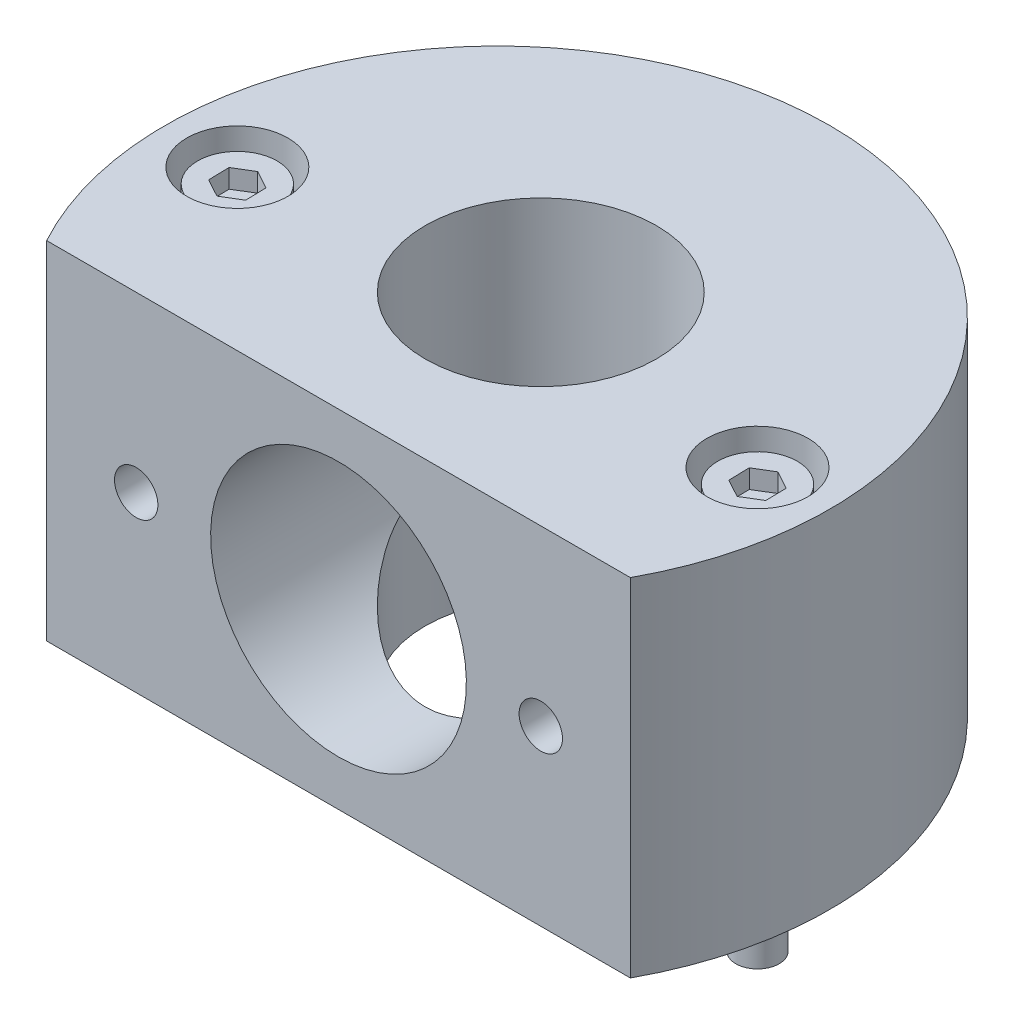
ISO-10303-21;
HEADER;
FILE_DESCRIPTION(('STEP AP214'),'2;1');
FILE_NAME('part.step','',(''),(''),'','','');
FILE_SCHEMA(('AUTOMOTIVE_DESIGN { 1 0 10303 214 1 1 1 1 }'));
ENDSEC;
DATA;
#1=APPLICATION_CONTEXT('core data for automotive mechanical design processes');
#2=APPLICATION_PROTOCOL_DEFINITION('international standard','automotive_design',2000,#1);
#3=PRODUCT_CONTEXT('',#1,'mechanical');
#4=PRODUCT('Part','Part','',(#3));
#5=PRODUCT_RELATED_PRODUCT_CATEGORY('part','',(#4));
#6=PRODUCT_DEFINITION_FORMATION('','',#4);
#7=PRODUCT_DEFINITION_CONTEXT('part definition',#1,'design');
#8=PRODUCT_DEFINITION('design','',#6,#7);
#9=PRODUCT_DEFINITION_SHAPE('','',#8);
#10=(LENGTH_UNIT() NAMED_UNIT(*) SI_UNIT(.MILLI.,.METRE.));
#11=(NAMED_UNIT(*) PLANE_ANGLE_UNIT() SI_UNIT($,.RADIAN.));
#12=(NAMED_UNIT(*) SI_UNIT($,.STERADIAN.) SOLID_ANGLE_UNIT());
#13=UNCERTAINTY_MEASURE_WITH_UNIT(LENGTH_MEASURE(1.E-05),#10,'distance_accuracy_value','');
#14=(GEOMETRIC_REPRESENTATION_CONTEXT(3) GLOBAL_UNCERTAINTY_ASSIGNED_CONTEXT((#13)) GLOBAL_UNIT_ASSIGNED_CONTEXT((#10,
#11,#12)) REPRESENTATION_CONTEXT('',''));
#15=CARTESIAN_POINT('',(0.,0.,0.));
#16=DIRECTION('',(0.,0.,1.));
#17=DIRECTION('',(1.,0.,0.));
#18=AXIS2_PLACEMENT_3D('',#15,#16,#17);
#19=CARTESIAN_POINT('',(-1.6759110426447E-13,24.,0.));
#20=DIRECTION('',(0.,-1.,0.));
#21=DIRECTION('',(1.,0.,0.));
#22=AXIS2_PLACEMENT_3D('',#19,#20,#21);
#23=CYLINDRICAL_SURFACE('',#22,23.);
#24=DIRECTION('',(0.,-1.,0.));
#25=VECTOR('',#24,1.);
#26=CARTESIAN_POINT('',(20.199009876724,24.,11.));
#27=LINE('',#26,#25);
#28=CARTESIAN_POINT('',(20.199009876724,24.,11.));
#29=VERTEX_POINT('',#28);
#30=CARTESIAN_POINT('',(20.1990098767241,1.79455226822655E-13,11.));
#31=VERTEX_POINT('',#30);
#32=EDGE_CURVE('E253',#29,#31,#27,.T.);
#33=ORIENTED_EDGE('',*,*,#32,.T.);
#34=CARTESIAN_POINT('',(0.,0.,0.));
#35=DIRECTION('',(0.,1.,0.));
#36=DIRECTION('',(-1.,0.,0.));
#37=AXIS2_PLACEMENT_3D('',#34,#35,#36);
#38=CIRCLE('',#37,23.);
#39=CARTESIAN_POINT('',(-20.1990098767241,-1.02642637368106E-13,11.));
#40=VERTEX_POINT('',#39);
#41=EDGE_CURVE('E27',#31,#40,#38,.T.);
#42=ORIENTED_EDGE('',*,*,#41,.T.);
#43=DIRECTION('',(0.,-1.,0.));
#44=VECTOR('',#43,1.);
#45=CARTESIAN_POINT('',(-20.1990098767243,24.,11.));
#46=LINE('',#45,#44);
#47=CARTESIAN_POINT('',(-20.1990098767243,24.,11.));
#48=VERTEX_POINT('',#47);
#49=EDGE_CURVE('E255',#48,#40,#46,.T.);
#50=ORIENTED_EDGE('',*,*,#49,.F.);
#51=CARTESIAN_POINT('',(-1.6759110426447E-13,24.,0.));
#52=DIRECTION('',(0.,1.,0.));
#53=DIRECTION('',(-1.,0.,0.));
#54=AXIS2_PLACEMENT_3D('',#51,#52,#53);
#55=CIRCLE('',#54,23.);
#56=EDGE_CURVE('E414',#29,#48,#55,.T.);
#57=ORIENTED_EDGE('',*,*,#56,.F.);
#58=EDGE_LOOP('',(#33,#42,#50,#57));
#59=FACE_BOUND('',#58,.T.);
#60=ADVANCED_FACE('F14',(#59),#23,.T.);
#61=CARTESIAN_POINT('',(-15.3,12.,5.));
#62=DIRECTION('',(0.,0.,-1.));
#63=DIRECTION('',(0.,-1.,0.));
#64=AXIS2_PLACEMENT_3D('',#61,#62,#63);
#65=PLANE('',#64);
#66=CARTESIAN_POINT('',(-14.,12.,5.));
#67=DIRECTION('',(0.,0.,1.));
#68=DIRECTION('',(0.,1.,0.));
#69=AXIS2_PLACEMENT_3D('',#66,#67,#68);
#70=CIRCLE('',#69,1.5);
#71=CARTESIAN_POINT('',(-14.,13.5,4.99999999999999));
#72=VERTEX_POINT('',#71);
#73=EDGE_CURVE('E246',#72,#72,#70,.T.);
#74=ORIENTED_EDGE('',*,*,#73,.T.);
#75=EDGE_LOOP('',(#74));
#76=FACE_BOUND('',#75,.T.);
#77=ADVANCED_FACE('F290',(#76),#65,.F.);
#78=CARTESIAN_POINT('',(-14.,12.,11.));
#79=DIRECTION('',(0.,0.,1.));
#80=DIRECTION('',(0.,1.,0.));
#81=AXIS2_PLACEMENT_3D('',#78,#79,#80);
#82=CYLINDRICAL_SURFACE('',#81,1.5);
#83=ORIENTED_EDGE('',*,*,#73,.F.);
#84=EDGE_LOOP('',(#83));
#85=FACE_BOUND('',#84,.T.);
#86=CARTESIAN_POINT('',(-14.,12.,11.));
#87=DIRECTION('',(0.,0.,-1.));
#88=DIRECTION('',(0.,-1.,0.));
#89=AXIS2_PLACEMENT_3D('',#86,#87,#88);
#90=CIRCLE('',#89,1.5);
#91=CARTESIAN_POINT('',(-14.,10.5,11.));
#92=VERTEX_POINT('',#91);
#93=EDGE_CURVE('E235',#92,#92,#90,.F.);
#94=ORIENTED_EDGE('',*,*,#93,.T.);
#95=EDGE_LOOP('',(#94));
#96=FACE_BOUND('',#95,.T.);
#97=ADVANCED_FACE('F293',(#85,#96),#82,.F.);
#98=CARTESIAN_POINT('',(-18.,24.,0.));
#99=DIRECTION('',(0.,1.,0.));
#100=DIRECTION('',(-1.,0.,0.));
#101=AXIS2_PLACEMENT_3D('',#98,#99,#100);
#102=CYLINDRICAL_SURFACE('',#101,3.5);
#103=CARTESIAN_POINT('',(-18.,20.,0.));
#104=DIRECTION('',(0.,1.,0.));
#105=DIRECTION('',(-1.,0.,0.));
#106=AXIS2_PLACEMENT_3D('',#103,#104,#105);
#107=CIRCLE('',#106,3.5);
#108=CARTESIAN_POINT('',(-21.5,20.,0.));
#109=VERTEX_POINT('',#108);
#110=EDGE_CURVE('E239',#109,#109,#107,.T.);
#111=ORIENTED_EDGE('',*,*,#110,.F.);
#112=EDGE_LOOP('',(#111));
#113=FACE_BOUND('',#112,.T.);
#114=CARTESIAN_POINT('',(-18.,24.,0.));
#115=DIRECTION('',(0.,1.,0.));
#116=DIRECTION('',(-1.,0.,0.));
#117=AXIS2_PLACEMENT_3D('',#114,#115,#116);
#118=CIRCLE('',#117,3.5);
#119=CARTESIAN_POINT('',(-21.5,24.,0.));
#120=VERTEX_POINT('',#119);
#121=EDGE_CURVE('E442',#120,#120,#118,.T.);
#122=ORIENTED_EDGE('',*,*,#121,.T.);
#123=EDGE_LOOP('',(#122));
#124=FACE_BOUND('',#123,.T.);
#125=ADVANCED_FACE('F304',(#113,#124),#102,.F.);
#126=CARTESIAN_POINT('',(-21.5,20.,0.));
#127=DIRECTION('',(0.,-1.,0.));
#128=DIRECTION('',(1.,0.,0.));
#129=AXIS2_PLACEMENT_3D('',#126,#127,#128);
#130=PLANE('',#129);
#131=CARTESIAN_POINT('',(-18.,20.,0.));
#132=DIRECTION('',(0.,-1.,0.));
#133=DIRECTION('',(1.,0.,0.));
#134=AXIS2_PLACEMENT_3D('',#131,#132,#133);
#135=CIRCLE('',#134,2.75);
#136=CARTESIAN_POINT('',(-15.25,20.,0.));
#137=VERTEX_POINT('',#136);
#138=EDGE_CURVE('E21',#137,#137,#135,.F.);
#139=ORIENTED_EDGE('',*,*,#138,.F.);
#140=EDGE_LOOP('',(#139));
#141=FACE_BOUND('',#140,.T.);
#142=ORIENTED_EDGE('',*,*,#110,.T.);
#143=EDGE_LOOP('',(#142));
#144=FACE_BOUND('',#143,.T.);
#145=ADVANCED_FACE('F301',(#141,#144),#130,.F.);
#146=CARTESIAN_POINT('',(-18.,24.,0.));
#147=DIRECTION('',(0.,1.,0.));
#148=DIRECTION('',(-1.,0.,0.));
#149=AXIS2_PLACEMENT_3D('',#146,#147,#148);
#150=CYLINDRICAL_SURFACE('',#149,1.75);
#151=CARTESIAN_POINT('',(-18.,20.,0.));
#152=DIRECTION('',(0.,1.,0.));
#153=DIRECTION('',(-1.,0.,0.));
#154=AXIS2_PLACEMENT_3D('',#151,#152,#153);
#155=CIRCLE('',#154,1.75);
#156=CARTESIAN_POINT('',(-19.75,20.,0.));
#157=VERTEX_POINT('',#156);
#158=EDGE_CURVE('E232',#157,#157,#155,.F.);
#159=ORIENTED_EDGE('',*,*,#158,.F.);
#160=EDGE_LOOP('',(#159));
#161=FACE_BOUND('',#160,.T.);
#162=CARTESIAN_POINT('',(-18.,-1.25693328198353E-13,0.));
#163=DIRECTION('',(0.,1.,0.));
#164=DIRECTION('',(-1.,0.,0.));
#165=AXIS2_PLACEMENT_3D('',#162,#163,#164);
#166=CIRCLE('',#165,1.75);
#167=CARTESIAN_POINT('',(-19.75,-1.37913512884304E-13,0.));
#168=VERTEX_POINT('',#167);
#169=EDGE_CURVE('E444',#168,#168,#166,.T.);
#170=ORIENTED_EDGE('',*,*,#169,.F.);
#171=EDGE_LOOP('',(#170));
#172=FACE_BOUND('',#171,.T.);
#173=ADVANCED_FACE('F299',(#161,#172),#150,.F.);
#174=CARTESIAN_POINT('',(12.7,12.,5.));
#175=DIRECTION('',(0.,0.,-1.));
#176=DIRECTION('',(0.,-1.,0.));
#177=AXIS2_PLACEMENT_3D('',#174,#175,#176);
#178=PLANE('',#177);
#179=CARTESIAN_POINT('',(14.,12.0000000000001,5.));
#180=DIRECTION('',(0.,0.,1.));
#181=DIRECTION('',(0.,1.,0.));
#182=AXIS2_PLACEMENT_3D('',#179,#180,#181);
#183=CIRCLE('',#182,1.5);
#184=CARTESIAN_POINT('',(14.,13.5000000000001,4.99999999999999));
#185=VERTEX_POINT('',#184);
#186=EDGE_CURVE('E243',#185,#185,#183,.T.);
#187=ORIENTED_EDGE('',*,*,#186,.T.);
#188=EDGE_LOOP('',(#187));
#189=FACE_BOUND('',#188,.T.);
#190=ADVANCED_FACE('F295',(#189),#178,.F.);
#191=CARTESIAN_POINT('',(14.,12.0000000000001,11.));
#192=DIRECTION('',(0.,0.,1.));
#193=DIRECTION('',(0.,1.,0.));
#194=AXIS2_PLACEMENT_3D('',#191,#192,#193);
#195=CYLINDRICAL_SURFACE('',#194,1.5);
#196=ORIENTED_EDGE('',*,*,#186,.F.);
#197=EDGE_LOOP('',(#196));
#198=FACE_BOUND('',#197,.T.);
#199=CARTESIAN_POINT('',(14.,12.0000000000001,11.));
#200=DIRECTION('',(0.,0.,-1.));
#201=DIRECTION('',(0.,-1.,0.));
#202=AXIS2_PLACEMENT_3D('',#199,#200,#201);
#203=CIRCLE('',#202,1.5);
#204=CARTESIAN_POINT('',(14.,10.5000000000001,11.));
#205=VERTEX_POINT('',#204);
#206=EDGE_CURVE('E240',#205,#205,#203,.F.);
#207=ORIENTED_EDGE('',*,*,#206,.T.);
#208=EDGE_LOOP('',(#207));
#209=FACE_BOUND('',#208,.T.);
#210=ADVANCED_FACE('F298',(#198,#209),#195,.F.);
#211=CARTESIAN_POINT('',(0.,0.,0.));
#212=DIRECTION('',(0.,1.,0.));
#213=DIRECTION('',(-1.,0.,0.));
#214=AXIS2_PLACEMENT_3D('',#211,#212,#213);
#215=PLANE('',#214);
#216=ORIENTED_EDGE('',*,*,#41,.F.);
#217=DIRECTION('',(1.,0.,0.));
#218=VECTOR('',#217,1.);
#219=CARTESIAN_POINT('',(20.1990098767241,1.79455226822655E-13,11.));
#220=LINE('',#219,#218);
#221=EDGE_CURVE('E418',#40,#31,#220,.T.);
#222=ORIENTED_EDGE('',*,*,#221,.F.);
#223=EDGE_LOOP('',(#216,#222));
#224=FACE_BOUND('',#223,.T.);
#225=ORIENTED_EDGE('',*,*,#169,.T.);
#226=EDGE_LOOP('',(#225));
#227=FACE_BOUND('',#226,.T.);
#228=CARTESIAN_POINT('',(0.,0.,-3.));
#229=DIRECTION('',(0.,1.,0.));
#230=DIRECTION('',(-1.,0.,0.));
#231=AXIS2_PLACEMENT_3D('',#228,#229,#230);
#232=CIRCLE('',#231,8.);
#233=CARTESIAN_POINT('',(-8.,0.,-3.));
#234=VERTEX_POINT('',#233);
#235=EDGE_CURVE('E464',#234,#234,#232,.T.);
#236=ORIENTED_EDGE('',*,*,#235,.T.);
#237=EDGE_LOOP('',(#236));
#238=FACE_BOUND('',#237,.T.);
#239=CARTESIAN_POINT('',(18.,1.25693328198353E-13,0.));
#240=DIRECTION('',(0.,1.,0.));
#241=DIRECTION('',(-1.,0.,0.));
#242=AXIS2_PLACEMENT_3D('',#239,#240,#241);
#243=CIRCLE('',#242,1.75);
#244=CARTESIAN_POINT('',(16.25,1.13473143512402E-13,0.));
#245=VERTEX_POINT('',#244);
#246=EDGE_CURVE('E428',#245,#245,#243,.T.);
#247=ORIENTED_EDGE('',*,*,#246,.T.);
#248=EDGE_LOOP('',(#247));
#249=FACE_BOUND('',#248,.T.);
#250=ADVANCED_FACE('F659',(#224,#227,#238,#249),#215,.F.);
#251=CARTESIAN_POINT('',(-1.6759110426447E-13,24.,0.));
#252=DIRECTION('',(0.,1.,0.));
#253=DIRECTION('',(-1.,0.,0.));
#254=AXIS2_PLACEMENT_3D('',#251,#252,#253);
#255=PLANE('',#254);
#256=ORIENTED_EDGE('',*,*,#121,.F.);
#257=EDGE_LOOP('',(#256));
#258=FACE_BOUND('',#257,.T.);
#259=DIRECTION('',(1.,0.,0.));
#260=VECTOR('',#259,1.);
#261=CARTESIAN_POINT('',(20.199009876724,24.,11.));
#262=LINE('',#261,#260);
#263=EDGE_CURVE('E417',#48,#29,#262,.T.);
#264=ORIENTED_EDGE('',*,*,#263,.T.);
#265=ORIENTED_EDGE('',*,*,#56,.T.);
#266=EDGE_LOOP('',(#264,#265));
#267=FACE_BOUND('',#266,.T.);
#268=CARTESIAN_POINT('',(-1.6759110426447E-13,24.,-3.00000000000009));
#269=DIRECTION('',(0.,1.,0.));
#270=DIRECTION('',(-1.,0.,0.));
#271=AXIS2_PLACEMENT_3D('',#268,#269,#270);
#272=CIRCLE('',#271,8.);
#273=CARTESIAN_POINT('',(-8.00000000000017,23.9999999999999,-3.00000000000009));
#274=VERTEX_POINT('',#273);
#275=EDGE_CURVE('E462',#274,#274,#272,.T.);
#276=ORIENTED_EDGE('',*,*,#275,.F.);
#277=EDGE_LOOP('',(#276));
#278=FACE_BOUND('',#277,.T.);
#279=CARTESIAN_POINT('',(18.,24.,0.));
#280=DIRECTION('',(0.,1.,0.));
#281=DIRECTION('',(-1.,0.,0.));
#282=AXIS2_PLACEMENT_3D('',#279,#280,#281);
#283=CIRCLE('',#282,3.5);
#284=CARTESIAN_POINT('',(14.5,24.,0.));
#285=VERTEX_POINT('',#284);
#286=EDGE_CURVE('E420',#285,#285,#283,.T.);
#287=ORIENTED_EDGE('',*,*,#286,.F.);
#288=EDGE_LOOP('',(#287));
#289=FACE_BOUND('',#288,.T.);
#290=ADVANCED_FACE('F457',(#258,#267,#278,#289),#255,.T.);
#291=CARTESIAN_POINT('',(20.199009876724,24.,11.));
#292=DIRECTION('',(0.,0.,-1.));
#293=DIRECTION('',(0.,-1.,0.));
#294=AXIS2_PLACEMENT_3D('',#291,#292,#293);
#295=PLANE('',#294);
#296=ORIENTED_EDGE('',*,*,#93,.F.);
#297=EDGE_LOOP('',(#296));
#298=FACE_BOUND('',#297,.T.);
#299=ORIENTED_EDGE('',*,*,#206,.F.);
#300=EDGE_LOOP('',(#299));
#301=FACE_BOUND('',#300,.T.);
#302=CARTESIAN_POINT('',(0.,12.,11.));
#303=DIRECTION('',(0.,0.,-1.));
#304=DIRECTION('',(0.,-1.,0.));
#305=AXIS2_PLACEMENT_3D('',#302,#303,#304);
#306=CIRCLE('',#305,8.85);
#307=CARTESIAN_POINT('',(0.,3.15,11.));
#308=VERTEX_POINT('',#307);
#309=EDGE_CURVE('E422',#308,#308,#306,.F.);
#310=ORIENTED_EDGE('',*,*,#309,.F.);
#311=EDGE_LOOP('',(#310));
#312=FACE_BOUND('',#311,.T.);
#313=ORIENTED_EDGE('',*,*,#49,.T.);
#314=ORIENTED_EDGE('',*,*,#221,.T.);
#315=ORIENTED_EDGE('',*,*,#32,.F.);
#316=ORIENTED_EDGE('',*,*,#263,.F.);
#317=EDGE_LOOP('',(#313,#314,#315,#316));
#318=FACE_BOUND('',#317,.T.);
#319=ADVANCED_FACE('F416',(#298,#301,#312,#318),#295,.F.);
#320=CARTESIAN_POINT('',(0.,12.,-3.00000000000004));
#321=DIRECTION('',(0.,0.,1.));
#322=DIRECTION('',(0.,1.,0.));
#323=AXIS2_PLACEMENT_3D('',#320,#321,#322);
#324=PLANE('',#323);
#325=CARTESIAN_POINT('',(0.,12.,-3.00000000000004));
#326=DIRECTION('',(0.,0.,1.));
#327=DIRECTION('',(0.,1.,0.));
#328=AXIS2_PLACEMENT_3D('',#325,#326,#327);
#329=CIRCLE('',#328,8.85);
#330=CARTESIAN_POINT('',(-8.00000000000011,15.7845078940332,-3.00000000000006));
#331=VERTEX_POINT('',#330);
#332=CARTESIAN_POINT('',(-8.,8.21549210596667,-3.));
#333=VERTEX_POINT('',#332);
#334=EDGE_CURVE('E250',#331,#333,#329,.T.);
#335=ORIENTED_EDGE('',*,*,#334,.T.);
#336=DIRECTION('',(0.,-1.,0.));
#337=VECTOR('',#336,1.);
#338=CARTESIAN_POINT('',(-8.00000000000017,24.,-3.00000000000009));
#339=LINE('',#338,#337);
#340=EDGE_CURVE('E468',#331,#333,#339,.T.);
#341=ORIENTED_EDGE('',*,*,#340,.F.);
#342=EDGE_LOOP('',(#335,#341));
#343=FACE_BOUND('',#342,.T.);
#344=ADVANCED_FACE('F288',(#343),#324,.T.);
#345=CARTESIAN_POINT('',(8.,8.21549210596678,-3.));
#346=VERTEX_POINT('',#345);
#347=CARTESIAN_POINT('',(7.99999999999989,15.7845078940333,-3.00000000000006));
#348=VERTEX_POINT('',#347);
#349=EDGE_CURVE('E249',#346,#348,#329,.T.);
#350=ORIENTED_EDGE('',*,*,#349,.T.);
#351=DIRECTION('',(0.,-1.,0.));
#352=VECTOR('',#351,1.);
#353=CARTESIAN_POINT('',(7.99999999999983,24.,-3.00000000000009));
#354=LINE('',#353,#352);
#355=EDGE_CURVE('E258',#346,#348,#354,.F.);
#356=ORIENTED_EDGE('',*,*,#355,.F.);
#357=EDGE_LOOP('',(#350,#356));
#358=FACE_BOUND('',#357,.T.);
#359=ADVANCED_FACE('F283',(#358),#324,.T.);
#360=CARTESIAN_POINT('',(0.,12.,11.));
#361=DIRECTION('',(0.,0.,-1.));
#362=DIRECTION('',(0.,-1.,0.));
#363=AXIS2_PLACEMENT_3D('',#360,#361,#362);
#364=CYLINDRICAL_SURFACE('',#363,8.85);
#365=ORIENTED_EDGE('',*,*,#309,.T.);
#366=EDGE_LOOP('',(#365));
#367=FACE_BOUND('',#366,.T.);
#368=ORIENTED_EDGE('',*,*,#349,.F.);
#369=CARTESIAN_POINT('',(-8.,8.21549210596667,-3.));
#370=CARTESIAN_POINT('',(-8.00003023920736,8.21561371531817,-2.87993756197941));
#371=CARTESIAN_POINT('',(-7.9972986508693,8.20978126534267,-2.75996053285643));
#372=CARTESIAN_POINT('',(-7.98656342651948,8.18718299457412,-2.52160092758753));
#373=CARTESIAN_POINT('',(-7.97857442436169,8.17044752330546,-2.40321485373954));
#374=CARTESIAN_POINT('',(-7.9577669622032,8.12740830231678,-2.17094288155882));
#375=CARTESIAN_POINT('',(-7.9450401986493,8.10128653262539,-2.05701425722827));
#376=CARTESIAN_POINT('',(-7.91507895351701,8.04081168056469,-1.83191481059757));
#377=CARTESIAN_POINT('',(-7.897841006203,8.0064522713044,-1.72074618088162));
#378=CARTESIAN_POINT('',(-7.84954361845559,7.91206830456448,-1.44676835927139));
#379=CARTESIAN_POINT('',(-7.81588029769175,7.84779435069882,-1.28588527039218));
#380=CARTESIAN_POINT('',(-7.74013371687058,7.70824757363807,-0.971064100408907));
#381=CARTESIAN_POINT('',(-7.69804587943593,7.63296877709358,-0.817129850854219));
#382=CARTESIAN_POINT('',(-7.60563721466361,7.47392801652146,-0.514113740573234));
#383=CARTESIAN_POINT('',(-7.55523474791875,7.39008543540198,-0.365099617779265));
#384=CARTESIAN_POINT('',(-7.446929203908,7.21709407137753,-0.0729693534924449));
#385=CARTESIAN_POINT('',(-7.38902331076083,7.12794330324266,0.0701445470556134));
#386=CARTESIAN_POINT('',(-7.22114806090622,6.88010068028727,0.453308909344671));
#387=CARTESIAN_POINT('',(-7.10397314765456,6.71804531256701,0.688055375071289));
#388=CARTESIAN_POINT('',(-6.84839597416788,6.39060968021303,1.14338100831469));
#389=CARTESIAN_POINT('',(-6.70998027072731,6.22522736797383,1.36395107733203));
#390=CARTESIAN_POINT('',(-6.41228151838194,5.89637855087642,1.7906240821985));
#391=CARTESIAN_POINT('',(-6.25306629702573,5.73290762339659,1.99677083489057));
#392=CARTESIAN_POINT('',(-5.91311051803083,5.41119327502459,2.39477100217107));
#393=CARTESIAN_POINT('',(-5.73238088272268,5.25294725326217,2.58663158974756));
#394=CARTESIAN_POINT('',(-5.39580818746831,4.98271473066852,2.9097865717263));
#395=CARTESIAN_POINT('',(-5.24466339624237,4.8688674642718,3.04443092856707));
#396=CARTESIAN_POINT('',(-4.92966821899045,4.64759097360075,3.30396881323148));
#397=CARTESIAN_POINT('',(-4.76581410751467,4.54016364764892,3.42885946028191));
#398=CARTESIAN_POINT('',(-4.42565317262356,4.33347098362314,3.66758774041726));
#399=CARTESIAN_POINT('',(-4.24935839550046,4.23419794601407,3.78143581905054));
#400=CARTESIAN_POINT('',(-3.88453853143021,4.04544198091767,3.99679776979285));
#401=CARTESIAN_POINT('',(-3.69602152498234,3.95595268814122,4.09831966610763));
#402=CARTESIAN_POINT('',(-3.34560765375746,3.80498353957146,4.26890933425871));
#403=CARTESIAN_POINT('',(-3.18578275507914,3.74145881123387,4.34043060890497));
#404=CARTESIAN_POINT('',(-2.85917459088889,3.62278179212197,4.47370084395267));
#405=CARTESIAN_POINT('',(-2.69239479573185,3.56762538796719,4.53545460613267));
#406=CARTESIAN_POINT('',(-2.35258663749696,3.46658072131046,4.64835790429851));
#407=CARTESIAN_POINT('',(-2.17955986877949,3.42069011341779,4.69951012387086));
#408=CARTESIAN_POINT('',(-1.82818722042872,3.33900933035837,4.79042090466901));
#409=CARTESIAN_POINT('',(-1.64984128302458,3.30321926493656,4.8301793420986));
#410=CARTESIAN_POINT('',(-1.28791644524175,3.24228043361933,4.89780783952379));
#411=CARTESIAN_POINT('',(-1.10431176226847,3.21719973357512,4.92560186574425));
#412=CARTESIAN_POINT('',(-0.734405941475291,3.17856449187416,4.96839439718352));
#413=CARTESIAN_POINT('',(-0.548104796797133,3.16500997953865,4.98339286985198));
#414=CARTESIAN_POINT('',(-0.174473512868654,3.14974530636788,5.00028257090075));
#415=CARTESIAN_POINT('',(0.0128563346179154,3.14803194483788,5.00217734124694));
#416=CARTESIAN_POINT('',(0.38690920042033,3.15648310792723,4.99282773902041));
#417=CARTESIAN_POINT('',(0.573632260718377,3.16664679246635,4.98158429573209));
#418=CARTESIAN_POINT('',(0.926347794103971,3.19701571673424,4.94796061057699));
#419=CARTESIAN_POINT('',(1.09255427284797,3.21612113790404,4.92679986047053));
#420=CARTESIAN_POINT('',(1.42210378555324,3.26341954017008,4.87435499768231));
#421=CARTESIAN_POINT('',(1.58544585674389,3.29161551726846,4.84306754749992));
#422=CARTESIAN_POINT('',(1.90818589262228,3.35659675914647,4.77085371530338));
#423=CARTESIAN_POINT('',(2.0675848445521,3.39337984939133,4.72992977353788));
#424=CARTESIAN_POINT('',(2.38171906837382,3.47496247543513,4.63898999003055));
#425=CARTESIAN_POINT('',(2.53645255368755,3.51976503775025,4.58897071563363));
#426=CARTESIAN_POINT('',(2.84850961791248,3.6192666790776,4.47762323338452));
#427=CARTESIAN_POINT('',(3.00554474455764,3.67436105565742,4.41584008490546));
#428=CARTESIAN_POINT('',(3.31311615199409,3.79189996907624,4.28363352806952));
#429=CARTESIAN_POINT('',(3.46364988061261,3.85434735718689,4.2132067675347));
#430=CARTESIAN_POINT('',(3.90480946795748,4.05150516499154,3.99006166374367));
#431=CARTESIAN_POINT('',(4.18516039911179,4.1960857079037,3.82541788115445));
#432=CARTESIAN_POINT('',(4.6534134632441,4.46850474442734,3.51194416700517));
#433=CARTESIAN_POINT('',(4.84750938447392,4.59222928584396,3.36856721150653));
#434=CARTESIAN_POINT('',(5.2185222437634,4.84875264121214,3.06827351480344));
#435=CARTESIAN_POINT('',(5.39543733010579,4.98155243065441,2.91135531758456));
#436=CARTESIAN_POINT('',(5.73274483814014,5.25423446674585,2.58488591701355));
#437=CARTESIAN_POINT('',(5.89307739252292,5.39413983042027,2.41529250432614));
#438=CARTESIAN_POINT('',(6.19677854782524,5.67816186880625,2.06494524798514));
#439=CARTESIAN_POINT('',(6.34015080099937,5.82227762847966,1.8841938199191));
#440=CARTESIAN_POINT('',(6.61348412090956,6.11565936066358,1.50747129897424));
#441=CARTESIAN_POINT('',(6.74304145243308,6.26496598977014,1.31123927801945));
#442=CARTESIAN_POINT('',(6.98493733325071,6.56218305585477,0.907191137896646));
#443=CARTESIAN_POINT('',(7.09726561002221,6.71009261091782,0.699368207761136));
#444=CARTESIAN_POINT('',(7.30419586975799,6.99972237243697,0.271851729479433));
#445=CARTESIAN_POINT('',(7.39884438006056,7.14145804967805,0.0521913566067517));
#446=CARTESIAN_POINT('',(7.56996903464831,7.41266320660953,-0.401118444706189));
#447=CARTESIAN_POINT('',(7.64647068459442,7.54214974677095,-0.634747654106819));
#448=CARTESIAN_POINT('',(7.77230109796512,7.76580208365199,-1.09181796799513));
#449=CARTESIAN_POINT('',(7.82370130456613,7.86229167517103,-1.31352025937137));
#450=CARTESIAN_POINT('',(7.90822843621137,8.02621121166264,-1.76990765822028));
#451=CARTESIAN_POINT('',(7.94146681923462,8.09381783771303,-2.00450362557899));
#452=CARTESIAN_POINT('',(7.97594766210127,8.16496196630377,-2.36778051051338));
#453=CARTESIAN_POINT('',(7.98488988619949,8.18367188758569,-2.49278841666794));
#454=CARTESIAN_POINT('',(7.99695143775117,8.20904567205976,-2.7451418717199));
#455=CARTESIAN_POINT('',(8.00003076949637,8.21562678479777,-2.8724975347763));
#456=CARTESIAN_POINT('',(8.,8.21549210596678,-3.));
#457=B_SPLINE_CURVE_WITH_KNOTS('',3,(#369,#370,#371,#372,#373,#374,#375,#376,#377,#378,#379,
#380,#381,#382,#383,#384,#385,#386,#387,#388,#389,#390,#391,#392,#393,#394,#395,#396,#397,#398,
#399,#400,#401,#402,#403,#404,#405,#406,#407,#408,#409,#410,#411,#412,#413,#414,#415,#416,#417,
#418,#419,#420,#421,#422,#423,#424,#425,#426,#427,#428,#429,#430,#431,#432,#433,#434,#435,#436,
#437,#438,#439,#440,#441,#442,#443,#444,#445,#446,#447,#448,#449,#450,#451,#452,#453,#454,#455,
#456),.UNSPECIFIED.,.F.,.F.,(4,2,2,2,2,2,2,2,2,2,2,2,2,2,2,2,2,2,2,2,2,2,2,2,2,2,2,2,2,2,2,2,2,
2,2,2,2,2,2,2,2,2,2,4),(0.,0.359878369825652,0.718759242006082,1.07102762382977,
1.42356743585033,1.95210568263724,2.48093188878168,3.01529876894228,3.54986676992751,
4.47372369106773,5.39816774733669,6.31966910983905,7.24070462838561,7.93685227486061,
8.6332047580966,9.32889197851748,10.0241238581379,10.5823953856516,11.1403916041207,
11.6982464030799,12.256107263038,12.8174627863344,13.3788197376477,13.9400249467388,
14.501190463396,15.0065171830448,15.5120106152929,16.0173761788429,16.5229328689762,
17.0549551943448,17.5871845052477,18.6510915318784,19.4636580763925,20.2763121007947,
21.0918045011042,21.9071209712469,22.7419762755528,23.5773274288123,24.4104482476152,
25.2423910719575,25.9821651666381,26.7173468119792,27.0968196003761,27.4788719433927),.UNSPECIFIED.);
#458=EDGE_CURVE('E261',#333,#346,#457,.T.);
#459=ORIENTED_EDGE('',*,*,#458,.F.);
#460=ORIENTED_EDGE('',*,*,#334,.F.);
#461=CARTESIAN_POINT('',(7.99999999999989,15.7845078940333,-3.00000000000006));
#462=CARTESIAN_POINT('',(8.00003023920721,15.7843862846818,-2.87993756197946));
#463=CARTESIAN_POINT('',(7.99729865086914,15.7902187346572,-2.75996053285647));
#464=CARTESIAN_POINT('',(7.98656342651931,15.8128170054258,-2.52160092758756));
#465=CARTESIAN_POINT('',(7.97857442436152,15.8295524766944,-2.40321485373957));
#466=CARTESIAN_POINT('',(7.95776696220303,15.8725916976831,-2.17094288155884));
#467=CARTESIAN_POINT('',(7.94504019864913,15.8987134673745,-2.05701425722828));
#468=CARTESIAN_POINT('',(7.91507895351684,15.9591883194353,-1.83191481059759));
#469=CARTESIAN_POINT('',(7.89784100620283,15.9935477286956,-1.72074618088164));
#470=CARTESIAN_POINT('',(7.84954361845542,16.0879316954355,-1.44676835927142));
#471=CARTESIAN_POINT('',(7.81588029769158,16.1522056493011,-1.28588527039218));
#472=CARTESIAN_POINT('',(7.7401337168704,16.2917524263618,-0.97106410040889));
#473=CARTESIAN_POINT('',(7.69804587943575,16.3670312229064,-0.817129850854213));
#474=CARTESIAN_POINT('',(7.60563721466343,16.5260719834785,-0.51411374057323));
#475=CARTESIAN_POINT('',(7.55523474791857,16.609914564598,-0.365099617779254));
#476=CARTESIAN_POINT('',(7.44692920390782,16.7829059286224,-0.0729693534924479));
#477=CARTESIAN_POINT('',(7.38902331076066,16.8720566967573,0.0701445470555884));
#478=CARTESIAN_POINT('',(7.22114806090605,17.1198993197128,0.453308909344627));
#479=CARTESIAN_POINT('',(7.10397314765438,17.281954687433,0.688055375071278));
#480=CARTESIAN_POINT('',(6.84839597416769,17.6093903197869,1.14338100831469));
#481=CARTESIAN_POINT('',(6.70998027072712,17.7747726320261,1.36395107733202));
#482=CARTESIAN_POINT('',(6.41228151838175,18.1036214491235,1.79062408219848));
#483=CARTESIAN_POINT('',(6.25306629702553,18.2670923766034,1.99677083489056));
#484=CARTESIAN_POINT('',(5.91311051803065,18.5888067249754,2.39477100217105));
#485=CARTESIAN_POINT('',(5.73238088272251,18.7470527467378,2.58663158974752));
#486=CARTESIAN_POINT('',(5.39580818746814,19.0172852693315,2.90978657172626));
#487=CARTESIAN_POINT('',(5.24466339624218,19.1311325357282,3.04443092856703));
#488=CARTESIAN_POINT('',(4.92966821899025,19.3524090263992,3.30396881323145));
#489=CARTESIAN_POINT('',(4.76581410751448,19.459836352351,3.42885946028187));
#490=CARTESIAN_POINT('',(4.42565317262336,19.6665290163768,3.66758774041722));
#491=CARTESIAN_POINT('',(4.24935839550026,19.7658020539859,3.78143581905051));
#492=CARTESIAN_POINT('',(3.88453853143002,19.9545580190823,3.99679776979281));
#493=CARTESIAN_POINT('',(3.69602152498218,20.0440473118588,4.09831966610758));
#494=CARTESIAN_POINT('',(3.34560765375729,20.1950164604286,4.26890933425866));
#495=CARTESIAN_POINT('',(3.18578275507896,20.2585411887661,4.34043060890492));
#496=CARTESIAN_POINT('',(2.85917459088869,20.377218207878,4.47370084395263));
#497=CARTESIAN_POINT('',(2.69239479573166,20.4323746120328,4.53545460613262));
#498=CARTESIAN_POINT('',(2.35258663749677,20.5334192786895,4.64835790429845));
#499=CARTESIAN_POINT('',(2.1795598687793,20.5793098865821,4.6995101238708));
#500=CARTESIAN_POINT('',(1.82818722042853,20.6609906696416,4.79042090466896));
#501=CARTESIAN_POINT('',(1.64984128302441,20.6967807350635,4.83017934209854));
#502=CARTESIAN_POINT('',(1.28791644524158,20.7577195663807,4.89780783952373));
#503=CARTESIAN_POINT('',(1.1043117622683,20.7828002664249,4.92560186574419));
#504=CARTESIAN_POINT('',(0.734405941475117,20.8214355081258,4.96839439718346));
#505=CARTESIAN_POINT('',(0.548104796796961,20.8349900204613,4.98339286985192));
#506=CARTESIAN_POINT('',(0.174473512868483,20.8502546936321,5.00028257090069));
#507=CARTESIAN_POINT('',(-0.0128563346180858,20.8519680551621,5.00217734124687));
#508=CARTESIAN_POINT('',(-0.386909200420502,20.8435168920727,4.99282773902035));
#509=CARTESIAN_POINT('',(-0.57363226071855,20.8333532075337,4.98158429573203));
#510=CARTESIAN_POINT('',(-0.926347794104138,20.8029842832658,4.94796061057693));
#511=CARTESIAN_POINT('',(-1.09255427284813,20.7838788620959,4.92679986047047));
#512=CARTESIAN_POINT('',(-1.4221037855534,20.7365804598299,4.87435499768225));
#513=CARTESIAN_POINT('',(-1.58544585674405,20.7083844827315,4.84306754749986));
#514=CARTESIAN_POINT('',(-1.90818589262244,20.6434032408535,4.77085371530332));
#515=CARTESIAN_POINT('',(-2.06758484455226,20.6066201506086,4.72992977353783));
#516=CARTESIAN_POINT('',(-2.38171906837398,20.5250375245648,4.63898999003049));
#517=CARTESIAN_POINT('',(-2.53645255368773,20.4802349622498,4.58897071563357));
#518=CARTESIAN_POINT('',(-2.84850961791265,20.3807333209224,4.47762323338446));
#519=CARTESIAN_POINT('',(-3.00554474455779,20.3256389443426,4.41584008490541));
#520=CARTESIAN_POINT('',(-3.31311615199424,20.2081000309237,4.28363352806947));
#521=CARTESIAN_POINT('',(-3.46364988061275,20.1456526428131,4.21320676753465));
#522=CARTESIAN_POINT('',(-3.90480946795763,19.9484948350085,3.99006166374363));
#523=CARTESIAN_POINT('',(-4.18516039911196,19.8039142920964,3.82541788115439));
#524=CARTESIAN_POINT('',(-4.65341346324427,19.5314952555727,3.51194416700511));
#525=CARTESIAN_POINT('',(-4.84750938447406,19.407770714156,3.36856721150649));
#526=CARTESIAN_POINT('',(-5.21852224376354,19.1512473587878,3.06827351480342));
#527=CARTESIAN_POINT('',(-5.39543733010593,19.0184475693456,2.91135531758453));
#528=CARTESIAN_POINT('',(-5.73274483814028,18.7457655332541,2.58488591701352));
#529=CARTESIAN_POINT('',(-5.89307739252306,18.6058601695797,2.41529250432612));
#530=CARTESIAN_POINT('',(-6.19677854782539,18.3218381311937,2.06494524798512));
#531=CARTESIAN_POINT('',(-6.34015080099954,18.1777223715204,1.88419381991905));
#532=CARTESIAN_POINT('',(-6.61348412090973,17.8843406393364,1.50747129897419));
#533=CARTESIAN_POINT('',(-6.74304145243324,17.7350340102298,1.31123927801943));
#534=CARTESIAN_POINT('',(-6.98493733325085,17.4378169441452,0.907191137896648));
#535=CARTESIAN_POINT('',(-7.09726561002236,17.2899073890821,0.699368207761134));
#536=CARTESIAN_POINT('',(-7.30419586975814,17.000277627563,0.27185172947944));
#537=CARTESIAN_POINT('',(-7.39884438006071,16.8585419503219,0.0521913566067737));
#538=CARTESIAN_POINT('',(-7.56996903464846,16.5873367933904,-0.401118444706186));
#539=CARTESIAN_POINT('',(-7.64647068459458,16.4578502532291,-0.634747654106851));
#540=CARTESIAN_POINT('',(-7.77230109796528,16.234197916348,-1.09181796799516));
#541=CARTESIAN_POINT('',(-7.82370130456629,16.1377083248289,-1.31352025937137));
#542=CARTESIAN_POINT('',(-7.90822843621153,15.9737887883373,-1.76990765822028));
#543=CARTESIAN_POINT('',(-7.94146681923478,15.906182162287,-2.00450362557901));
#544=CARTESIAN_POINT('',(-7.97594766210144,15.8350380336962,-2.36778051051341));
#545=CARTESIAN_POINT('',(-7.98488988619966,15.8163281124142,-2.49278841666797));
#546=CARTESIAN_POINT('',(-7.99695143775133,15.7909543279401,-2.74514187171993));
#547=CARTESIAN_POINT('',(-8.00003076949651,15.7843732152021,-2.87249753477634));
#548=CARTESIAN_POINT('',(-8.00000000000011,15.7845078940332,-3.00000000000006));
#549=B_SPLINE_CURVE_WITH_KNOTS('',3,(#461,#462,#463,#464,#465,#466,#467,#468,#469,#470,#471,
#472,#473,#474,#475,#476,#477,#478,#479,#480,#481,#482,#483,#484,#485,#486,#487,#488,#489,#490,
#491,#492,#493,#494,#495,#496,#497,#498,#499,#500,#501,#502,#503,#504,#505,#506,#507,#508,#509,
#510,#511,#512,#513,#514,#515,#516,#517,#518,#519,#520,#521,#522,#523,#524,#525,#526,#527,#528,
#529,#530,#531,#532,#533,#534,#535,#536,#537,#538,#539,#540,#541,#542,#543,#544,#545,#546,#547,
#548),.UNSPECIFIED.,.F.,.F.,(4,2,2,2,2,2,2,2,2,2,2,2,2,2,2,2,2,2,2,2,2,2,2,2,2,2,2,2,2,2,2,2,2,
2,2,2,2,2,2,2,2,2,2,4),(0.,0.359878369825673,0.718759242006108,1.0710276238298,1.42356743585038,
1.9521056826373,2.48093188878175,3.01529876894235,3.54986676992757,4.4737236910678,
5.39816774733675,6.31966910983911,7.24070462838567,7.93685227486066,8.63320475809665,
9.32889197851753,10.0241238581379,10.5823953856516,11.1403916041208,11.6982464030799,
12.256107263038,12.8174627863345,13.3788197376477,13.9400249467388,14.5011904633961,
15.0065171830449,15.5120106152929,16.0173761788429,16.5229328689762,17.0549551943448,
17.5871845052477,18.6510915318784,19.4636580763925,20.2763121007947,21.0918045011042,
21.9071209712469,22.7419762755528,23.5773274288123,24.4104482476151,25.2423910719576,
25.9821651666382,26.7173468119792,27.0968196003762,27.4788719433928),.UNSPECIFIED.);
#550=EDGE_CURVE('E270',#348,#331,#549,.T.);
#551=ORIENTED_EDGE('',*,*,#550,.F.);
#552=EDGE_LOOP('',(#368,#459,#460,#551));
#553=FACE_BOUND('',#552,.T.);
#554=ADVANCED_FACE('F279',(#367,#553),#364,.F.);
#555=CARTESIAN_POINT('',(-1.6759110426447E-13,24.,-3.00000000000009));
#556=DIRECTION('',(0.,-1.,0.));
#557=DIRECTION('',(1.,0.,0.));
#558=AXIS2_PLACEMENT_3D('',#555,#556,#557);
#559=CYLINDRICAL_SURFACE('',#558,8.);
#560=ORIENTED_EDGE('',*,*,#235,.F.);
#561=EDGE_LOOP('',(#560));
#562=FACE_BOUND('',#561,.T.);
#563=ORIENTED_EDGE('',*,*,#275,.T.);
#564=EDGE_LOOP('',(#563));
#565=FACE_BOUND('',#564,.T.);
#566=ORIENTED_EDGE('',*,*,#550,.T.);
#567=ORIENTED_EDGE('',*,*,#340,.T.);
#568=ORIENTED_EDGE('',*,*,#458,.T.);
#569=ORIENTED_EDGE('',*,*,#355,.T.);
#570=EDGE_LOOP('',(#566,#567,#568,#569));
#571=FACE_BOUND('',#570,.T.);
#572=ADVANCED_FACE('F276',(#562,#565,#571),#559,.F.);
#573=CARTESIAN_POINT('',(18.,24.,0.));
#574=DIRECTION('',(0.,1.,0.));
#575=DIRECTION('',(-1.,0.,0.));
#576=AXIS2_PLACEMENT_3D('',#573,#574,#575);
#577=CYLINDRICAL_SURFACE('',#576,3.5);
#578=CARTESIAN_POINT('',(18.,20.,0.));
#579=DIRECTION('',(0.,1.,0.));
#580=DIRECTION('',(-1.,0.,0.));
#581=AXIS2_PLACEMENT_3D('',#578,#579,#580);
#582=CIRCLE('',#581,3.5);
#583=CARTESIAN_POINT('',(14.5,20.,0.));
#584=VERTEX_POINT('',#583);
#585=EDGE_CURVE('E236',#584,#584,#582,.T.);
#586=ORIENTED_EDGE('',*,*,#585,.F.);
#587=EDGE_LOOP('',(#586));
#588=FACE_BOUND('',#587,.T.);
#589=ORIENTED_EDGE('',*,*,#286,.T.);
#590=EDGE_LOOP('',(#589));
#591=FACE_BOUND('',#590,.T.);
#592=ADVANCED_FACE('F310',(#588,#591),#577,.F.);
#593=CARTESIAN_POINT('',(14.4999999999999,20.,0.));
#594=DIRECTION('',(0.,-1.,0.));
#595=DIRECTION('',(1.,0.,0.));
#596=AXIS2_PLACEMENT_3D('',#593,#594,#595);
#597=PLANE('',#596);
#598=CARTESIAN_POINT('',(18.,20.,0.));
#599=DIRECTION('',(0.,-1.,0.));
#600=DIRECTION('',(1.,0.,0.));
#601=AXIS2_PLACEMENT_3D('',#598,#599,#600);
#602=CIRCLE('',#601,2.75);
#603=CARTESIAN_POINT('',(20.75,20.,0.));
#604=VERTEX_POINT('',#603);
#605=EDGE_CURVE('E9',#604,#604,#602,.F.);
#606=ORIENTED_EDGE('',*,*,#605,.F.);
#607=EDGE_LOOP('',(#606));
#608=FACE_BOUND('',#607,.T.);
#609=ORIENTED_EDGE('',*,*,#585,.T.);
#610=EDGE_LOOP('',(#609));
#611=FACE_BOUND('',#610,.T.);
#612=ADVANCED_FACE('F306',(#608,#611),#597,.F.);
#613=CARTESIAN_POINT('',(18.,24.,0.));
#614=DIRECTION('',(0.,1.,0.));
#615=DIRECTION('',(-1.,0.,0.));
#616=AXIS2_PLACEMENT_3D('',#613,#614,#615);
#617=CYLINDRICAL_SURFACE('',#616,1.75);
#618=CARTESIAN_POINT('',(18.,20.,0.));
#619=DIRECTION('',(0.,1.,0.));
#620=DIRECTION('',(-1.,0.,0.));
#621=AXIS2_PLACEMENT_3D('',#618,#619,#620);
#622=CIRCLE('',#621,1.75);
#623=CARTESIAN_POINT('',(16.25,20.,0.));
#624=VERTEX_POINT('',#623);
#625=EDGE_CURVE('E135',#624,#624,#622,.F.);
#626=ORIENTED_EDGE('',*,*,#625,.F.);
#627=EDGE_LOOP('',(#626));
#628=FACE_BOUND('',#627,.T.);
#629=ORIENTED_EDGE('',*,*,#246,.F.);
#630=EDGE_LOOP('',(#629));
#631=FACE_BOUND('',#630,.T.);
#632=ADVANCED_FACE('F309',(#628,#631),#617,.F.);
#633=CARTESIAN_POINT('',(-18.,-5.00000000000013,0.));
#634=DIRECTION('',(0.,1.,0.));
#635=DIRECTION('',(-0.999761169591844,0.,0.0218541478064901));
#636=AXIS2_PLACEMENT_3D('',#633,#634,#635);
#637=PLANE('',#636);
#638=CARTESIAN_POINT('',(-18.,-5.00000000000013,0.));
#639=DIRECTION('',(0.,1.,0.));
#640=DIRECTION('',(-0.999761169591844,0.,0.0218541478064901));
#641=AXIS2_PLACEMENT_3D('',#638,#639,#640);
#642=CIRCLE('',#641,1.5);
#643=CARTESIAN_POINT('',(-19.4996417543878,-5.00000000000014,0.0327812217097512));
#644=VERTEX_POINT('',#643);
#645=EDGE_CURVE('E224',#644,#644,#642,.T.);
#646=ORIENTED_EDGE('',*,*,#645,.F.);
#647=EDGE_LOOP('',(#646));
#648=FACE_BOUND('',#647,.T.);
#649=ADVANCED_FACE('F328',(#648),#637,.F.);
#650=CARTESIAN_POINT('',(-18.,-5.00000000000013,0.));
#651=DIRECTION('',(0.,1.,0.));
#652=DIRECTION('',(-0.999761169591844,0.,0.0218541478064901));
#653=AXIS2_PLACEMENT_3D('',#650,#651,#652);
#654=CYLINDRICAL_SURFACE('',#653,1.5);
#655=ORIENTED_EDGE('',*,*,#645,.T.);
#656=EDGE_LOOP('',(#655));
#657=FACE_BOUND('',#656,.T.);
#658=CARTESIAN_POINT('',(-18.,20.,0.));
#659=DIRECTION('',(0.,1.,0.));
#660=DIRECTION('',(-0.999761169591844,0.,0.0218541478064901));
#661=AXIS2_PLACEMENT_3D('',#658,#659,#660);
#662=CIRCLE('',#661,1.5);
#663=CARTESIAN_POINT('',(-19.4996417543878,20.,0.0327812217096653));
#664=VERTEX_POINT('',#663);
#665=EDGE_CURVE('E213',#664,#664,#662,.T.);
#666=ORIENTED_EDGE('',*,*,#665,.F.);
#667=EDGE_LOOP('',(#666));
#668=FACE_BOUND('',#667,.T.);
#669=ADVANCED_FACE('F320',(#657,#668),#654,.T.);
#670=CARTESIAN_POINT('',(-18.,20.,0.));
#671=DIRECTION('',(0.,1.,0.));
#672=DIRECTION('',(-0.999761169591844,0.,0.0218541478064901));
#673=AXIS2_PLACEMENT_3D('',#670,#671,#672);
#674=PLANE('',#673);
#675=ORIENTED_EDGE('',*,*,#665,.T.);
#676=EDGE_LOOP('',(#675));
#677=FACE_BOUND('',#676,.T.);
#678=ORIENTED_EDGE('',*,*,#158,.T.);
#679=EDGE_LOOP('',(#678));
#680=FACE_BOUND('',#679,.T.);
#681=ADVANCED_FACE('F316',(#677,#680),#674,.F.);
#682=CARTESIAN_POINT('',(-18.,23.,0.));
#683=DIRECTION('',(0.,-1.,0.));
#684=DIRECTION('',(0.999761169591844,0.,-0.0218541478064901));
#685=AXIS2_PLACEMENT_3D('',#682,#683,#684);
#686=CYLINDRICAL_SURFACE('',#685,2.75);
#687=CARTESIAN_POINT('',(-18.,23.,0.));
#688=DIRECTION('',(0.,1.,0.));
#689=DIRECTION('',(-0.999761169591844,0.,0.0218541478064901));
#690=AXIS2_PLACEMENT_3D('',#687,#688,#689);
#691=CIRCLE('',#690,2.75);
#692=CARTESIAN_POINT('',(-20.7493432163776,23.,0.0600989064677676));
#693=VERTEX_POINT('',#692);
#694=EDGE_CURVE('E227',#693,#693,#691,.T.);
#695=ORIENTED_EDGE('',*,*,#694,.F.);
#696=EDGE_LOOP('',(#695));
#697=FACE_BOUND('',#696,.T.);
#698=ORIENTED_EDGE('',*,*,#138,.T.);
#699=EDGE_LOOP('',(#698));
#700=FACE_BOUND('',#699,.T.);
#701=ADVANCED_FACE('F312',(#697,#700),#686,.T.);
#702=CARTESIAN_POINT('',(-18.,23.,0.));
#703=DIRECTION('',(0.,1.,0.));
#704=DIRECTION('',(-0.999761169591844,0.,0.0218541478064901));
#705=AXIS2_PLACEMENT_3D('',#702,#703,#704);
#706=PLANE('',#705);
#707=DIRECTION('',(0.876745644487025,0.,0.480954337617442));
#708=VECTOR('',#707,1.);
#709=CARTESIAN_POINT('',(-19.2339295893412,23.,0.748833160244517));
#710=LINE('',#709,#708);
#711=CARTESIAN_POINT('',(-19.2339295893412,23.,0.748833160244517));
#712=VERTEX_POINT('',#711);
#713=CARTESIAN_POINT('',(-17.9684562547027,23.,1.44303095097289));
#714=VERTEX_POINT('',#713);
#715=EDGE_CURVE('E175',#712,#714,#710,.T.);
#716=ORIENTED_EDGE('',*,*,#715,.F.);
#717=DIRECTION('',(0.0218541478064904,0.,0.999761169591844));
#718=VECTOR('',#717,1.);
#719=CARTESIAN_POINT('',(-19.2654733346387,23.,-0.694197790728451));
#720=LINE('',#719,#718);
#721=CARTESIAN_POINT('',(-19.2654733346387,23.,-0.694197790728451));
#722=VERTEX_POINT('',#721);
#723=EDGE_CURVE('E180',#722,#712,#720,.T.);
#724=ORIENTED_EDGE('',*,*,#723,.F.);
#725=DIRECTION('',(-0.854891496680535,0.,0.518806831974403));
#726=VECTOR('',#725,1.);
#727=CARTESIAN_POINT('',(-18.0315437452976,23.,-1.44303095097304));
#728=LINE('',#727,#726);
#729=CARTESIAN_POINT('',(-18.0315437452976,23.,-1.44303095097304));
#730=VERTEX_POINT('',#729);
#731=EDGE_CURVE('E206',#730,#722,#728,.T.);
#732=ORIENTED_EDGE('',*,*,#731,.F.);
#733=DIRECTION('',(-0.876745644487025,0.,-0.480954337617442));
#734=VECTOR('',#733,1.);
#735=CARTESIAN_POINT('',(-16.7660704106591,23.,-0.748833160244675));
#736=LINE('',#735,#734);
#737=CARTESIAN_POINT('',(-16.7660704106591,23.,-0.748833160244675));
#738=VERTEX_POINT('',#737);
#739=EDGE_CURVE('E203',#738,#730,#736,.T.);
#740=ORIENTED_EDGE('',*,*,#739,.F.);
#741=DIRECTION('',(-0.0218541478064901,0.,-0.999761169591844));
#742=VECTOR('',#741,1.);
#743=CARTESIAN_POINT('',(-16.7345266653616,23.,0.694197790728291));
#744=LINE('',#743,#742);
#745=CARTESIAN_POINT('',(-16.7345266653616,23.,0.694197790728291));
#746=VERTEX_POINT('',#745);
#747=EDGE_CURVE('E200',#746,#738,#744,.T.);
#748=ORIENTED_EDGE('',*,*,#747,.F.);
#749=DIRECTION('',(0.854891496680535,0.,-0.518806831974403));
#750=VECTOR('',#749,1.);
#751=CARTESIAN_POINT('',(-17.9684562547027,23.,1.44303095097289));
#752=LINE('',#751,#750);
#753=EDGE_CURVE('E197',#714,#746,#752,.T.);
#754=ORIENTED_EDGE('',*,*,#753,.F.);
#755=EDGE_LOOP('',(#716,#724,#732,#740,#748,#754));
#756=FACE_BOUND('',#755,.T.);
#757=ORIENTED_EDGE('',*,*,#694,.T.);
#758=EDGE_LOOP('',(#757));
#759=FACE_BOUND('',#758,.T.);
#760=ADVANCED_FACE('F315',(#756,#759),#706,.T.);
#761=CARTESIAN_POINT('',(-19.2339295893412,21.7,0.748833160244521));
#762=DIRECTION('',(-0.480954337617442,0.,0.876745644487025));
#763=DIRECTION('',(0.876745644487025,0.,0.480954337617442));
#764=AXIS2_PLACEMENT_3D('',#761,#762,#763);
#765=PLANE('',#764);
#766=ORIENTED_EDGE('',*,*,#715,.T.);
#767=DIRECTION('',(0.,1.,0.));
#768=VECTOR('',#767,1.);
#769=CARTESIAN_POINT('',(-17.9684562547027,21.7,1.44303095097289));
#770=LINE('',#769,#768);
#771=CARTESIAN_POINT('',(-17.9684562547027,21.7,1.44303095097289));
#772=VERTEX_POINT('',#771);
#773=EDGE_CURVE('E195',#772,#714,#770,.T.);
#774=ORIENTED_EDGE('',*,*,#773,.F.);
#775=DIRECTION('',(0.876745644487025,0.,0.480954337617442));
#776=VECTOR('',#775,1.);
#777=CARTESIAN_POINT('',(-19.2339295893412,21.7,0.748833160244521));
#778=LINE('',#777,#776);
#779=CARTESIAN_POINT('',(-19.2339295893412,21.7,0.748833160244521));
#780=VERTEX_POINT('',#779);
#781=EDGE_CURVE('E176',#780,#772,#778,.T.);
#782=ORIENTED_EDGE('',*,*,#781,.F.);
#783=DIRECTION('',(0.,1.,0.));
#784=VECTOR('',#783,1.);
#785=CARTESIAN_POINT('',(-19.2339295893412,21.7,0.748833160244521));
#786=LINE('',#785,#784);
#787=EDGE_CURVE('E211',#780,#712,#786,.T.);
#788=ORIENTED_EDGE('',*,*,#787,.T.);
#789=EDGE_LOOP('',(#766,#774,#782,#788));
#790=FACE_BOUND('',#789,.T.);
#791=ADVANCED_FACE('F324',(#790),#765,.F.);
#792=CARTESIAN_POINT('',(-19.2654733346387,21.7,-0.694197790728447));
#793=DIRECTION('',(-0.999761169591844,0.,0.0218541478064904));
#794=DIRECTION('',(0.0218541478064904,0.,0.999761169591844));
#795=AXIS2_PLACEMENT_3D('',#792,#793,#794);
#796=PLANE('',#795);
#797=ORIENTED_EDGE('',*,*,#723,.T.);
#798=ORIENTED_EDGE('',*,*,#787,.F.);
#799=DIRECTION('',(0.0218541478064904,0.,0.999761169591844));
#800=VECTOR('',#799,1.);
#801=CARTESIAN_POINT('',(-19.2654733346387,21.7,-0.694197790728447));
#802=LINE('',#801,#800);
#803=CARTESIAN_POINT('',(-19.2654733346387,21.7,-0.694197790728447));
#804=VERTEX_POINT('',#803);
#805=EDGE_CURVE('E192',#804,#780,#802,.T.);
#806=ORIENTED_EDGE('',*,*,#805,.F.);
#807=DIRECTION('',(0.,1.,0.));
#808=VECTOR('',#807,1.);
#809=CARTESIAN_POINT('',(-19.2654733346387,21.7,-0.694197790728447));
#810=LINE('',#809,#808);
#811=EDGE_CURVE('E214',#804,#722,#810,.T.);
#812=ORIENTED_EDGE('',*,*,#811,.T.);
#813=EDGE_LOOP('',(#797,#798,#806,#812));
#814=FACE_BOUND('',#813,.T.);
#815=ADVANCED_FACE('F335',(#814),#796,.F.);
#816=CARTESIAN_POINT('',(-18.0315437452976,21.7,-1.44303095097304));
#817=DIRECTION('',(-0.518806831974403,0.,-0.854891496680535));
#818=DIRECTION('',(-0.854891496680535,0.,0.518806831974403));
#819=AXIS2_PLACEMENT_3D('',#816,#817,#818);
#820=PLANE('',#819);
#821=ORIENTED_EDGE('',*,*,#731,.T.);
#822=ORIENTED_EDGE('',*,*,#811,.F.);
#823=DIRECTION('',(-0.854891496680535,0.,0.518806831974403));
#824=VECTOR('',#823,1.);
#825=CARTESIAN_POINT('',(-18.0315437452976,21.7,-1.44303095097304));
#826=LINE('',#825,#824);
#827=CARTESIAN_POINT('',(-18.0315437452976,21.7,-1.44303095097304));
#828=VERTEX_POINT('',#827);
#829=EDGE_CURVE('E189',#828,#804,#826,.T.);
#830=ORIENTED_EDGE('',*,*,#829,.F.);
#831=DIRECTION('',(0.,1.,0.));
#832=VECTOR('',#831,1.);
#833=CARTESIAN_POINT('',(-18.0315437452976,21.7,-1.44303095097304));
#834=LINE('',#833,#832);
#835=EDGE_CURVE('E216',#828,#730,#834,.T.);
#836=ORIENTED_EDGE('',*,*,#835,.T.);
#837=EDGE_LOOP('',(#821,#822,#830,#836));
#838=FACE_BOUND('',#837,.T.);
#839=ADVANCED_FACE('F349',(#838),#820,.F.);
#840=CARTESIAN_POINT('',(-16.7660704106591,21.7,-0.748833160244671));
#841=DIRECTION('',(0.480954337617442,0.,-0.876745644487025));
#842=DIRECTION('',(-0.876745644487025,0.,-0.480954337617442));
#843=AXIS2_PLACEMENT_3D('',#840,#841,#842);
#844=PLANE('',#843);
#845=ORIENTED_EDGE('',*,*,#739,.T.);
#846=ORIENTED_EDGE('',*,*,#835,.F.);
#847=DIRECTION('',(-0.876745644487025,0.,-0.480954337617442));
#848=VECTOR('',#847,1.);
#849=CARTESIAN_POINT('',(-16.7660704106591,21.7,-0.748833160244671));
#850=LINE('',#849,#848);
#851=CARTESIAN_POINT('',(-16.7660704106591,21.7,-0.748833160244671));
#852=VERTEX_POINT('',#851);
#853=EDGE_CURVE('E186',#852,#828,#850,.T.);
#854=ORIENTED_EDGE('',*,*,#853,.F.);
#855=DIRECTION('',(0.,1.,0.));
#856=VECTOR('',#855,1.);
#857=CARTESIAN_POINT('',(-16.7660704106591,21.7,-0.748833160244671));
#858=LINE('',#857,#856);
#859=EDGE_CURVE('E218',#852,#738,#858,.T.);
#860=ORIENTED_EDGE('',*,*,#859,.T.);
#861=EDGE_LOOP('',(#845,#846,#854,#860));
#862=FACE_BOUND('',#861,.T.);
#863=ADVANCED_FACE('F345',(#862),#844,.F.);
#864=CARTESIAN_POINT('',(-16.7345266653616,21.7,0.694197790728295));
#865=DIRECTION('',(0.999761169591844,0.,-0.0218541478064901));
#866=DIRECTION('',(0.,1.,0.));
#867=AXIS2_PLACEMENT_3D('',#864,#865,#866);
#868=PLANE('',#867);
#869=ORIENTED_EDGE('',*,*,#747,.T.);
#870=ORIENTED_EDGE('',*,*,#859,.F.);
#871=DIRECTION('',(-0.0218541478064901,0.,-0.999761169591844));
#872=VECTOR('',#871,1.);
#873=CARTESIAN_POINT('',(-16.7345266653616,21.7,0.694197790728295));
#874=LINE('',#873,#872);
#875=CARTESIAN_POINT('',(-16.7345266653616,21.7,0.694197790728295));
#876=VERTEX_POINT('',#875);
#877=EDGE_CURVE('E183',#876,#852,#874,.T.);
#878=ORIENTED_EDGE('',*,*,#877,.F.);
#879=DIRECTION('',(0.,1.,0.));
#880=VECTOR('',#879,1.);
#881=CARTESIAN_POINT('',(-16.7345266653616,21.7,0.694197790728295));
#882=LINE('',#881,#880);
#883=EDGE_CURVE('E220',#876,#746,#882,.T.);
#884=ORIENTED_EDGE('',*,*,#883,.T.);
#885=EDGE_LOOP('',(#869,#870,#878,#884));
#886=FACE_BOUND('',#885,.T.);
#887=ADVANCED_FACE('F341',(#886),#868,.F.);
#888=CARTESIAN_POINT('',(-17.9684562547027,21.7,1.44303095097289));
#889=DIRECTION('',(0.518806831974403,0.,0.854891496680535));
#890=DIRECTION('',(0.854891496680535,0.,-0.518806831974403));
#891=AXIS2_PLACEMENT_3D('',#888,#889,#890);
#892=PLANE('',#891);
#893=ORIENTED_EDGE('',*,*,#753,.T.);
#894=ORIENTED_EDGE('',*,*,#883,.F.);
#895=DIRECTION('',(0.854891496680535,0.,-0.518806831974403));
#896=VECTOR('',#895,1.);
#897=CARTESIAN_POINT('',(-17.9684562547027,21.7,1.44303095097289));
#898=LINE('',#897,#896);
#899=EDGE_CURVE('E179',#772,#876,#898,.T.);
#900=ORIENTED_EDGE('',*,*,#899,.F.);
#901=ORIENTED_EDGE('',*,*,#773,.T.);
#902=EDGE_LOOP('',(#893,#894,#900,#901));
#903=FACE_BOUND('',#902,.T.);
#904=ADVANCED_FACE('F337',(#903),#892,.F.);
#905=CARTESIAN_POINT('',(-18.,21.7,0.));
#906=DIRECTION('',(0.,1.,0.));
#907=DIRECTION('',(-0.999761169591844,0.,0.0218541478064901));
#908=AXIS2_PLACEMENT_3D('',#905,#906,#907);
#909=PLANE('',#908);
#910=ORIENTED_EDGE('',*,*,#781,.T.);
#911=ORIENTED_EDGE('',*,*,#899,.T.);
#912=ORIENTED_EDGE('',*,*,#877,.T.);
#913=ORIENTED_EDGE('',*,*,#853,.T.);
#914=ORIENTED_EDGE('',*,*,#829,.T.);
#915=ORIENTED_EDGE('',*,*,#805,.T.);
#916=EDGE_LOOP('',(#910,#911,#912,#913,#914,#915));
#917=FACE_BOUND('',#916,.T.);
#918=ADVANCED_FACE('F340',(#917),#909,.T.);
#919=CARTESIAN_POINT('',(18.,-4.99999999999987,0.));
#920=DIRECTION('',(0.,1.,0.));
#921=DIRECTION('',(-0.999761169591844,0.,0.0218541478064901));
#922=AXIS2_PLACEMENT_3D('',#919,#920,#921);
#923=PLANE('',#922);
#924=CARTESIAN_POINT('',(18.,-4.99999999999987,0.));
#925=DIRECTION('',(0.,1.,0.));
#926=DIRECTION('',(-0.999761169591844,0.,0.0218541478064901));
#927=AXIS2_PLACEMENT_3D('',#924,#925,#926);
#928=CIRCLE('',#927,1.5);
#929=CARTESIAN_POINT('',(16.5003582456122,-4.99999999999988,0.0327812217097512));
#930=VERTEX_POINT('',#929);
#931=EDGE_CURVE('E779',#930,#930,#928,.T.);
#932=ORIENTED_EDGE('',*,*,#931,.F.);
#933=EDGE_LOOP('',(#932));
#934=FACE_BOUND('',#933,.T.);
#935=ADVANCED_FACE('F359',(#934),#923,.F.);
#936=CARTESIAN_POINT('',(18.,-4.99999999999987,0.));
#937=DIRECTION('',(0.,1.,0.));
#938=DIRECTION('',(-0.999761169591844,0.,0.0218541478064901));
#939=AXIS2_PLACEMENT_3D('',#936,#937,#938);
#940=CYLINDRICAL_SURFACE('',#939,1.5);
#941=ORIENTED_EDGE('',*,*,#931,.T.);
#942=EDGE_LOOP('',(#941));
#943=FACE_BOUND('',#942,.T.);
#944=CARTESIAN_POINT('',(18.,20.,0.));
#945=DIRECTION('',(0.,1.,0.));
#946=DIRECTION('',(-0.999761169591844,0.,0.0218541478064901));
#947=AXIS2_PLACEMENT_3D('',#944,#945,#946);
#948=CIRCLE('',#947,1.5);
#949=CARTESIAN_POINT('',(16.5003582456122,20.,0.0327812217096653));
#950=VERTEX_POINT('',#949);
#951=EDGE_CURVE('E782',#950,#950,#948,.T.);
#952=ORIENTED_EDGE('',*,*,#951,.F.);
#953=EDGE_LOOP('',(#952));
#954=FACE_BOUND('',#953,.T.);
#955=ADVANCED_FACE('F387',(#943,#954),#940,.T.);
#956=CARTESIAN_POINT('',(18.,20.,0.));
#957=DIRECTION('',(0.,1.,0.));
#958=DIRECTION('',(-0.999761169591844,0.,0.0218541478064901));
#959=AXIS2_PLACEMENT_3D('',#956,#957,#958);
#960=PLANE('',#959);
#961=ORIENTED_EDGE('',*,*,#951,.T.);
#962=EDGE_LOOP('',(#961));
#963=FACE_BOUND('',#962,.T.);
#964=ORIENTED_EDGE('',*,*,#625,.T.);
#965=EDGE_LOOP('',(#964));
#966=FACE_BOUND('',#965,.T.);
#967=ADVANCED_FACE('F391',(#963,#966),#960,.F.);
#968=CARTESIAN_POINT('',(18.,23.,0.));
#969=DIRECTION('',(0.,-1.,0.));
#970=DIRECTION('',(0.999761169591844,0.,-0.0218541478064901));
#971=AXIS2_PLACEMENT_3D('',#968,#969,#970);
#972=CYLINDRICAL_SURFACE('',#971,2.75);
#973=CARTESIAN_POINT('',(18.,23.,0.));
#974=DIRECTION('',(0.,1.,0.));
#975=DIRECTION('',(-0.999761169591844,0.,0.0218541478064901));
#976=AXIS2_PLACEMENT_3D('',#973,#974,#975);
#977=CIRCLE('',#976,2.75);
#978=CARTESIAN_POINT('',(15.2506567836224,23.,0.0600989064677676));
#979=VERTEX_POINT('',#978);
#980=EDGE_CURVE('E777',#979,#979,#977,.T.);
#981=ORIENTED_EDGE('',*,*,#980,.F.);
#982=EDGE_LOOP('',(#981));
#983=FACE_BOUND('',#982,.T.);
#984=ORIENTED_EDGE('',*,*,#605,.T.);
#985=EDGE_LOOP('',(#984));
#986=FACE_BOUND('',#985,.T.);
#987=ADVANCED_FACE('F395',(#983,#986),#972,.T.);
#988=CARTESIAN_POINT('',(18.,23.,0.));
#989=DIRECTION('',(0.,1.,0.));
#990=DIRECTION('',(-0.999761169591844,0.,0.0218541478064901));
#991=AXIS2_PLACEMENT_3D('',#988,#989,#990);
#992=PLANE('',#991);
#993=DIRECTION('',(0.876745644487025,0.,0.480954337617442));
#994=VECTOR('',#993,1.);
#995=CARTESIAN_POINT('',(16.7660704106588,23.,0.748833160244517));
#996=LINE('',#995,#994);
#997=CARTESIAN_POINT('',(16.7660704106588,23.,0.748833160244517));
#998=VERTEX_POINT('',#997);
#999=CARTESIAN_POINT('',(18.0315437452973,23.,1.44303095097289));
#1000=VERTEX_POINT('',#999);
#1001=EDGE_CURVE('E124',#998,#1000,#996,.T.);
#1002=ORIENTED_EDGE('',*,*,#1001,.F.);
#1003=DIRECTION('',(0.0218541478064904,0.,0.999761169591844));
#1004=VECTOR('',#1003,1.);
#1005=CARTESIAN_POINT('',(16.7345266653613,23.,-0.694197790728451));
#1006=LINE('',#1005,#1004);
#1007=CARTESIAN_POINT('',(16.7345266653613,23.,-0.694197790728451));
#1008=VERTEX_POINT('',#1007);
#1009=EDGE_CURVE('E172',#1008,#998,#1006,.T.);
#1010=ORIENTED_EDGE('',*,*,#1009,.F.);
#1011=DIRECTION('',(-0.854891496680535,0.,0.518806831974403));
#1012=VECTOR('',#1011,1.);
#1013=CARTESIAN_POINT('',(17.9684562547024,23.,-1.44303095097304));
#1014=LINE('',#1013,#1012);
#1015=CARTESIAN_POINT('',(17.9684562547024,23.,-1.44303095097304));
#1016=VERTEX_POINT('',#1015);
#1017=EDGE_CURVE('E796',#1016,#1008,#1014,.T.);
#1018=ORIENTED_EDGE('',*,*,#1017,.F.);
#1019=DIRECTION('',(-0.876745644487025,0.,-0.480954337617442));
#1020=VECTOR('',#1019,1.);
#1021=CARTESIAN_POINT('',(19.233929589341,23.,-0.748833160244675));
#1022=LINE('',#1021,#1020);
#1023=CARTESIAN_POINT('',(19.233929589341,23.,-0.748833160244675));
#1024=VERTEX_POINT('',#1023);
#1025=EDGE_CURVE('E154',#1024,#1016,#1022,.T.);
#1026=ORIENTED_EDGE('',*,*,#1025,.F.);
#1027=DIRECTION('',(-0.0218541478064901,0.,-0.999761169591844));
#1028=VECTOR('',#1027,1.);
#1029=CARTESIAN_POINT('',(19.2654733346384,23.,0.694197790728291));
#1030=LINE('',#1029,#1028);
#1031=CARTESIAN_POINT('',(19.2654733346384,23.,0.694197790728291));
#1032=VERTEX_POINT('',#1031);
#1033=EDGE_CURVE('E152',#1032,#1024,#1030,.T.);
#1034=ORIENTED_EDGE('',*,*,#1033,.F.);
#1035=DIRECTION('',(0.854891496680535,0.,-0.518806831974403));
#1036=VECTOR('',#1035,1.);
#1037=CARTESIAN_POINT('',(18.0315437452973,23.,1.44303095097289));
#1038=LINE('',#1037,#1036);
#1039=EDGE_CURVE('E136',#1000,#1032,#1038,.T.);
#1040=ORIENTED_EDGE('',*,*,#1039,.F.);
#1041=EDGE_LOOP('',(#1002,#1010,#1018,#1026,#1034,#1040));
#1042=FACE_BOUND('',#1041,.T.);
#1043=ORIENTED_EDGE('',*,*,#980,.T.);
#1044=EDGE_LOOP('',(#1043));
#1045=FACE_BOUND('',#1044,.T.);
#1046=ADVANCED_FACE('F148',(#1042,#1045),#992,.T.);
#1047=CARTESIAN_POINT('',(16.7660704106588,21.7,0.748833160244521));
#1048=DIRECTION('',(-0.480954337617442,0.,0.876745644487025));
#1049=DIRECTION('',(0.876745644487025,0.,0.480954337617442));
#1050=AXIS2_PLACEMENT_3D('',#1047,#1048,#1049);
#1051=PLANE('',#1050);
#1052=ORIENTED_EDGE('',*,*,#1001,.T.);
#1053=DIRECTION('',(0.,1.,0.));
#1054=VECTOR('',#1053,1.);
#1055=CARTESIAN_POINT('',(18.0315437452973,21.7,1.44303095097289));
#1056=LINE('',#1055,#1054);
#1057=CARTESIAN_POINT('',(18.0315437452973,21.7,1.44303095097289));
#1058=VERTEX_POINT('',#1057);
#1059=EDGE_CURVE('E128',#1058,#1000,#1056,.T.);
#1060=ORIENTED_EDGE('',*,*,#1059,.F.);
#1061=DIRECTION('',(0.876745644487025,0.,0.480954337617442));
#1062=VECTOR('',#1061,1.);
#1063=CARTESIAN_POINT('',(16.7660704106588,21.7,0.748833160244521));
#1064=LINE('',#1063,#1062);
#1065=CARTESIAN_POINT('',(16.7660704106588,21.7,0.748833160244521));
#1066=VERTEX_POINT('',#1065);
#1067=EDGE_CURVE('E170',#1066,#1058,#1064,.T.);
#1068=ORIENTED_EDGE('',*,*,#1067,.F.);
#1069=DIRECTION('',(0.,1.,0.));
#1070=VECTOR('',#1069,1.);
#1071=CARTESIAN_POINT('',(16.7660704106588,21.7,0.748833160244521));
#1072=LINE('',#1071,#1070);
#1073=EDGE_CURVE('E130',#1066,#998,#1072,.T.);
#1074=ORIENTED_EDGE('',*,*,#1073,.T.);
#1075=EDGE_LOOP('',(#1052,#1060,#1068,#1074));
#1076=FACE_BOUND('',#1075,.T.);
#1077=ADVANCED_FACE('F126',(#1076),#1051,.F.);
#1078=CARTESIAN_POINT('',(16.7345266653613,21.7,-0.694197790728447));
#1079=DIRECTION('',(-0.999761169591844,0.,0.0218541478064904));
#1080=DIRECTION('',(0.0218541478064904,0.,0.999761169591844));
#1081=AXIS2_PLACEMENT_3D('',#1078,#1079,#1080);
#1082=PLANE('',#1081);
#1083=ORIENTED_EDGE('',*,*,#1009,.T.);
#1084=ORIENTED_EDGE('',*,*,#1073,.F.);
#1085=DIRECTION('',(0.0218541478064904,0.,0.999761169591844));
#1086=VECTOR('',#1085,1.);
#1087=CARTESIAN_POINT('',(16.7345266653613,21.7,-0.694197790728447));
#1088=LINE('',#1087,#1086);
#1089=CARTESIAN_POINT('',(16.7345266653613,21.7,-0.694197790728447));
#1090=VERTEX_POINT('',#1089);
#1091=EDGE_CURVE('E145',#1090,#1066,#1088,.T.);
#1092=ORIENTED_EDGE('',*,*,#1091,.F.);
#1093=DIRECTION('',(0.,1.,0.));
#1094=VECTOR('',#1093,1.);
#1095=CARTESIAN_POINT('',(16.7345266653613,21.7,-0.694197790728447));
#1096=LINE('',#1095,#1094);
#1097=EDGE_CURVE('E792',#1090,#1008,#1096,.T.);
#1098=ORIENTED_EDGE('',*,*,#1097,.T.);
#1099=EDGE_LOOP('',(#1083,#1084,#1092,#1098));
#1100=FACE_BOUND('',#1099,.T.);
#1101=ADVANCED_FACE('F365',(#1100),#1082,.F.);
#1102=CARTESIAN_POINT('',(17.9684562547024,21.7,-1.44303095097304));
#1103=DIRECTION('',(-0.518806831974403,0.,-0.854891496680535));
#1104=DIRECTION('',(-0.854891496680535,0.,0.518806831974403));
#1105=AXIS2_PLACEMENT_3D('',#1102,#1103,#1104);
#1106=PLANE('',#1105);
#1107=ORIENTED_EDGE('',*,*,#1017,.T.);
#1108=ORIENTED_EDGE('',*,*,#1097,.F.);
#1109=DIRECTION('',(-0.854891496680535,0.,0.518806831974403));
#1110=VECTOR('',#1109,1.);
#1111=CARTESIAN_POINT('',(17.9684562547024,21.7,-1.44303095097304));
#1112=LINE('',#1111,#1110);
#1113=CARTESIAN_POINT('',(17.9684562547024,21.7,-1.44303095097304));
#1114=VERTEX_POINT('',#1113);
#1115=EDGE_CURVE('E160',#1114,#1090,#1112,.T.);
#1116=ORIENTED_EDGE('',*,*,#1115,.F.);
#1117=DIRECTION('',(0.,1.,0.));
#1118=VECTOR('',#1117,1.);
#1119=CARTESIAN_POINT('',(17.9684562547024,21.7,-1.44303095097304));
#1120=LINE('',#1119,#1118);
#1121=EDGE_CURVE('E790',#1114,#1016,#1120,.T.);
#1122=ORIENTED_EDGE('',*,*,#1121,.T.);
#1123=EDGE_LOOP('',(#1107,#1108,#1116,#1122));
#1124=FACE_BOUND('',#1123,.T.);
#1125=ADVANCED_FACE('F368',(#1124),#1106,.F.);
#1126=CARTESIAN_POINT('',(19.233929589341,21.7,-0.748833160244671));
#1127=DIRECTION('',(0.480954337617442,0.,-0.876745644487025));
#1128=DIRECTION('',(-0.876745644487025,0.,-0.480954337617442));
#1129=AXIS2_PLACEMENT_3D('',#1126,#1127,#1128);
#1130=PLANE('',#1129);
#1131=ORIENTED_EDGE('',*,*,#1025,.T.);
#1132=ORIENTED_EDGE('',*,*,#1121,.F.);
#1133=DIRECTION('',(-0.876745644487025,0.,-0.480954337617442));
#1134=VECTOR('',#1133,1.);
#1135=CARTESIAN_POINT('',(19.233929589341,21.7,-0.748833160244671));
#1136=LINE('',#1135,#1134);
#1137=CARTESIAN_POINT('',(19.233929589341,21.7,-0.748833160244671));
#1138=VERTEX_POINT('',#1137);
#1139=EDGE_CURVE('E163',#1138,#1114,#1136,.T.);
#1140=ORIENTED_EDGE('',*,*,#1139,.F.);
#1141=DIRECTION('',(0.,1.,0.));
#1142=VECTOR('',#1141,1.);
#1143=CARTESIAN_POINT('',(19.233929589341,21.7,-0.748833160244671));
#1144=LINE('',#1143,#1142);
#1145=EDGE_CURVE('E788',#1138,#1024,#1144,.T.);
#1146=ORIENTED_EDGE('',*,*,#1145,.T.);
#1147=EDGE_LOOP('',(#1131,#1132,#1140,#1146));
#1148=FACE_BOUND('',#1147,.T.);
#1149=ADVANCED_FACE('F372',(#1148),#1130,.F.);
#1150=CARTESIAN_POINT('',(19.2654733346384,21.7,0.694197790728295));
#1151=DIRECTION('',(0.999761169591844,0.,-0.0218541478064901));
#1152=DIRECTION('',(0.,1.,0.));
#1153=AXIS2_PLACEMENT_3D('',#1150,#1151,#1152);
#1154=PLANE('',#1153);
#1155=ORIENTED_EDGE('',*,*,#1033,.T.);
#1156=ORIENTED_EDGE('',*,*,#1145,.F.);
#1157=DIRECTION('',(-0.0218541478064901,0.,-0.999761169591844));
#1158=VECTOR('',#1157,1.);
#1159=CARTESIAN_POINT('',(19.2654733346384,21.7,0.694197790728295));
#1160=LINE('',#1159,#1158);
#1161=CARTESIAN_POINT('',(19.2654733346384,21.7,0.694197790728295));
#1162=VERTEX_POINT('',#1161);
#1163=EDGE_CURVE('E166',#1162,#1138,#1160,.T.);
#1164=ORIENTED_EDGE('',*,*,#1163,.F.);
#1165=DIRECTION('',(0.,1.,0.));
#1166=VECTOR('',#1165,1.);
#1167=CARTESIAN_POINT('',(19.2654733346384,21.7,0.694197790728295));
#1168=LINE('',#1167,#1166);
#1169=EDGE_CURVE('E146',#1162,#1032,#1168,.T.);
#1170=ORIENTED_EDGE('',*,*,#1169,.T.);
#1171=EDGE_LOOP('',(#1155,#1156,#1164,#1170));
#1172=FACE_BOUND('',#1171,.T.);
#1173=ADVANCED_FACE('F376',(#1172),#1154,.F.);
#1174=CARTESIAN_POINT('',(18.0315437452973,21.7,1.44303095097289));
#1175=DIRECTION('',(0.518806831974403,0.,0.854891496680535));
#1176=DIRECTION('',(0.854891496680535,0.,-0.518806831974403));
#1177=AXIS2_PLACEMENT_3D('',#1174,#1175,#1176);
#1178=PLANE('',#1177);
#1179=ORIENTED_EDGE('',*,*,#1039,.T.);
#1180=ORIENTED_EDGE('',*,*,#1169,.F.);
#1181=DIRECTION('',(0.854891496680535,0.,-0.518806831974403));
#1182=VECTOR('',#1181,1.);
#1183=CARTESIAN_POINT('',(18.0315437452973,21.7,1.44303095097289));
#1184=LINE('',#1183,#1182);
#1185=EDGE_CURVE('E143',#1058,#1162,#1184,.T.);
#1186=ORIENTED_EDGE('',*,*,#1185,.F.);
#1187=ORIENTED_EDGE('',*,*,#1059,.T.);
#1188=EDGE_LOOP('',(#1179,#1180,#1186,#1187));
#1189=FACE_BOUND('',#1188,.T.);
#1190=ADVANCED_FACE('F140',(#1189),#1178,.F.);
#1191=CARTESIAN_POINT('',(18.,21.7,0.));
#1192=DIRECTION('',(0.,1.,0.));
#1193=DIRECTION('',(-0.999761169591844,0.,0.0218541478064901));
#1194=AXIS2_PLACEMENT_3D('',#1191,#1192,#1193);
#1195=PLANE('',#1194);
#1196=ORIENTED_EDGE('',*,*,#1067,.T.);
#1197=ORIENTED_EDGE('',*,*,#1185,.T.);
#1198=ORIENTED_EDGE('',*,*,#1163,.T.);
#1199=ORIENTED_EDGE('',*,*,#1139,.T.);
#1200=ORIENTED_EDGE('',*,*,#1115,.T.);
#1201=ORIENTED_EDGE('',*,*,#1091,.T.);
#1202=EDGE_LOOP('',(#1196,#1197,#1198,#1199,#1200,#1201));
#1203=FACE_BOUND('',#1202,.T.);
#1204=ADVANCED_FACE('F361',(#1203),#1195,.T.);
#1205=CLOSED_SHELL('',(#60,#77,#97,#125,#145,#173,#190,#210,#250,#290,#319,#344,#359,#554,#572,
#592,#612,#632,#649,#669,#681,#701,#760,#791,#815,#839,#863,#887,#904,#918,#935,#955,#967,#987,
#1046,#1077,#1101,#1125,#1149,#1173,#1190,#1204));
#1206=MANIFOLD_SOLID_BREP('B1',#1205);
#1207=ADVANCED_BREP_SHAPE_REPRESENTATION('',(#18,#1206),#14);
#1208=SHAPE_DEFINITION_REPRESENTATION(#9,#1207);
ENDSEC;
END-ISO-10303-21;
